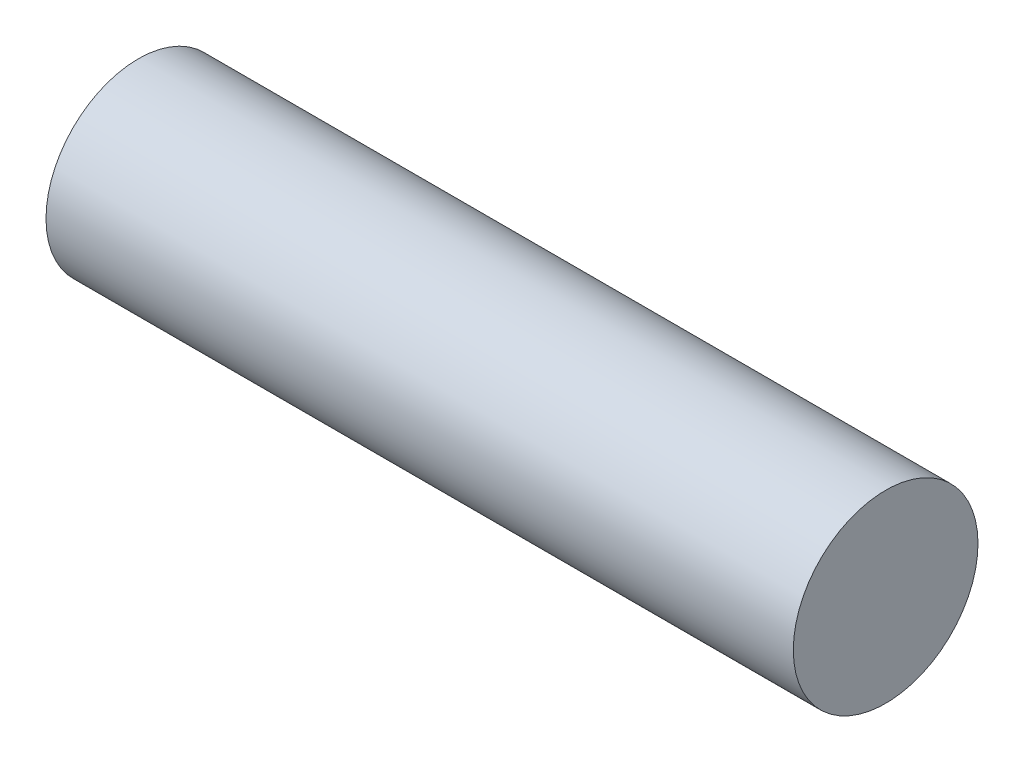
from build123d import *


with BuildPart() as part:
    # Skizze1 → Rotation1 (revolve)
    with BuildSketch(Plane.XY.offset(8)):
        with BuildLine():
            Line((54.07, 1.25), (43.954754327, 1.25))
            ThreePointArc((43.954754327, 1.25), (44.215784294, 0.64907088), (44.305, 0))
            Line((44.305, 0), (54.07, 0))
            Line((54.07, 0), (54.07, 1.25))
        make_face()
    revolve(axis=Axis((0, 0, 8), (1, 0, 0)))


solid = part.part
